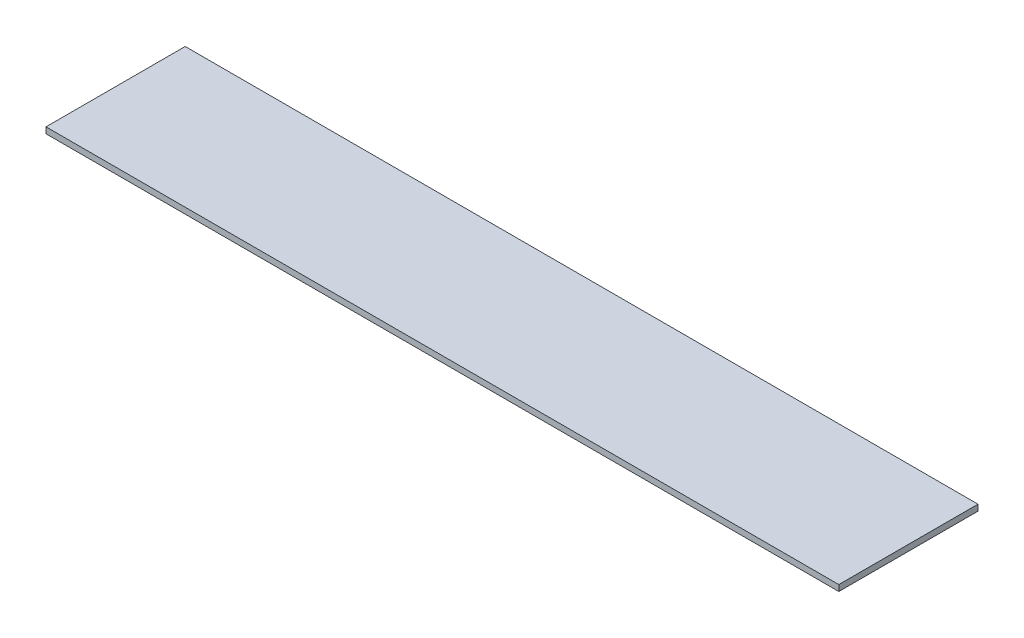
from build123d import *

# Parameters (mm, degrees)
SKETCH1_W           = 1663.7
SKETCH1_H           = 292.1
BOSS_EXTRUDE1_DEPTH = 12.7


with BuildPart() as part:
    # Sketch1 → Boss-Extrude1 (new body)
    with BuildSketch(Plane(origin=(0, 0, 0), x_dir=(1, 0, 0), z_dir=(0, 1, 0))):
        Rectangle(SKETCH1_W, SKETCH1_H)
    extrude(amount=BOSS_EXTRUDE1_DEPTH)


solid = part.part
